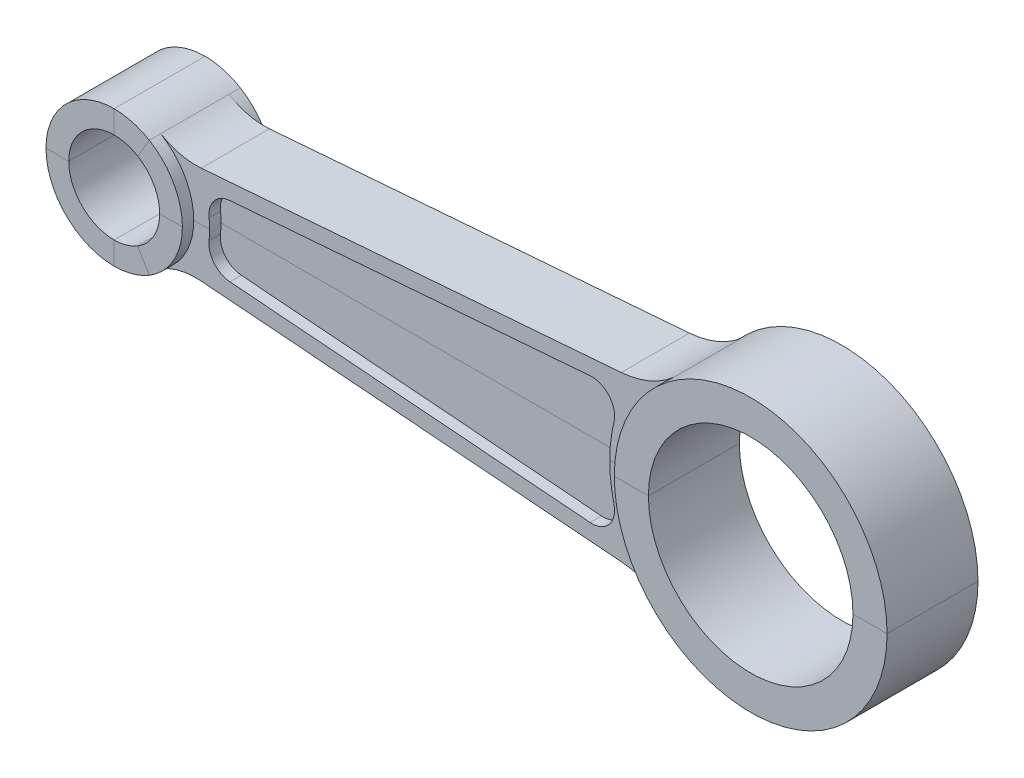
ISO-10303-21;
HEADER;
FILE_DESCRIPTION(('STEP AP214'),'2;1');
FILE_NAME('part.step','',(''),(''),'','','');
FILE_SCHEMA(('AUTOMOTIVE_DESIGN { 1 0 10303 214 1 1 1 1 }'));
ENDSEC;
DATA;
#1=APPLICATION_CONTEXT('core data for automotive mechanical design processes');
#2=APPLICATION_PROTOCOL_DEFINITION('international standard','automotive_design',2000,#1);
#3=PRODUCT_CONTEXT('',#1,'mechanical');
#4=PRODUCT('Part','Part','',(#3));
#5=PRODUCT_RELATED_PRODUCT_CATEGORY('part','',(#4));
#6=PRODUCT_DEFINITION_FORMATION('','',#4);
#7=PRODUCT_DEFINITION_CONTEXT('part definition',#1,'design');
#8=PRODUCT_DEFINITION('design','',#6,#7);
#9=PRODUCT_DEFINITION_SHAPE('','',#8);
#10=(LENGTH_UNIT() NAMED_UNIT(*) SI_UNIT(.MILLI.,.METRE.));
#11=(NAMED_UNIT(*) PLANE_ANGLE_UNIT() SI_UNIT($,.RADIAN.));
#12=(NAMED_UNIT(*) SI_UNIT($,.STERADIAN.) SOLID_ANGLE_UNIT());
#13=UNCERTAINTY_MEASURE_WITH_UNIT(LENGTH_MEASURE(1.E-05),#10,'distance_accuracy_value','');
#14=(GEOMETRIC_REPRESENTATION_CONTEXT(3) GLOBAL_UNCERTAINTY_ASSIGNED_CONTEXT((#13)) GLOBAL_UNIT_ASSIGNED_CONTEXT((#10,
#11,#12)) REPRESENTATION_CONTEXT('',''));
#15=CARTESIAN_POINT('',(0.,0.,0.));
#16=DIRECTION('',(0.,0.,1.));
#17=DIRECTION('',(1.,0.,0.));
#18=AXIS2_PLACEMENT_3D('',#15,#16,#17);
#19=CARTESIAN_POINT('',(0.,0.,-25.4));
#20=DIRECTION('',(0.,0.,1.));
#21=DIRECTION('',(1.,0.,0.));
#22=AXIS2_PLACEMENT_3D('',#19,#20,#21);
#23=CYLINDRICAL_SURFACE('',#22,25.4);
#24=DIRECTION('',(0.,0.,1.));
#25=VECTOR('',#24,1.);
#26=CARTESIAN_POINT('',(-25.4,0.,-25.4));
#27=LINE('',#26,#25);
#28=CARTESIAN_POINT('',(-25.4,0.,-25.4));
#29=VERTEX_POINT('',#28);
#30=CARTESIAN_POINT('',(-25.4,0.,25.4));
#31=VERTEX_POINT('',#30);
#32=EDGE_CURVE('E11',#29,#31,#27,.T.);
#33=ORIENTED_EDGE('',*,*,#32,.F.);
#34=CARTESIAN_POINT('',(0.,0.,-25.4));
#35=DIRECTION('',(0.,0.,1.));
#36=DIRECTION('',(1.,0.,0.));
#37=AXIS2_PLACEMENT_3D('',#34,#35,#36);
#38=CIRCLE('',#37,25.4);
#39=CARTESIAN_POINT('',(0.,25.4,-25.4));
#40=VERTEX_POINT('',#39);
#41=EDGE_CURVE('E418',#40,#29,#38,.T.);
#42=ORIENTED_EDGE('',*,*,#41,.F.);
#43=DIRECTION('',(0.,0.,1.));
#44=VECTOR('',#43,1.);
#45=CARTESIAN_POINT('',(0.,25.4,-25.4));
#46=LINE('',#45,#44);
#47=CARTESIAN_POINT('',(0.,25.4,25.4));
#48=VERTEX_POINT('',#47);
#49=EDGE_CURVE('E570',#48,#40,#46,.F.);
#50=ORIENTED_EDGE('',*,*,#49,.F.);
#51=CARTESIAN_POINT('',(0.,0.,25.4));
#52=DIRECTION('',(0.,0.,1.));
#53=DIRECTION('',(1.,0.,0.));
#54=AXIS2_PLACEMENT_3D('',#51,#52,#53);
#55=CIRCLE('',#54,25.4);
#56=EDGE_CURVE('E407',#48,#31,#55,.T.);
#57=ORIENTED_EDGE('',*,*,#56,.T.);
#58=EDGE_LOOP('',(#33,#42,#50,#57));
#59=FACE_BOUND('',#58,.T.);
#60=ADVANCED_FACE('F40',(#59),#23,.F.);
#61=CARTESIAN_POINT('',(0.,0.,-25.4));
#62=DIRECTION('',(0.,0.,1.));
#63=DIRECTION('',(1.,0.,0.));
#64=AXIS2_PLACEMENT_3D('',#61,#62,#63);
#65=CYLINDRICAL_SURFACE('',#64,38.1);
#66=CARTESIAN_POINT('',(0.,0.,-25.4));
#67=DIRECTION('',(0.,0.,1.));
#68=DIRECTION('',(1.,0.,0.));
#69=AXIS2_PLACEMENT_3D('',#66,#67,#68);
#70=CIRCLE('',#69,38.1);
#71=CARTESIAN_POINT('',(0.,38.1,-25.4));
#72=VERTEX_POINT('',#71);
#73=CARTESIAN_POINT('',(-38.1,0.,-25.4));
#74=VERTEX_POINT('',#73);
#75=EDGE_CURVE('E424',#72,#74,#70,.T.);
#76=ORIENTED_EDGE('',*,*,#75,.T.);
#77=DIRECTION('',(0.,0.,1.));
#78=VECTOR('',#77,1.);
#79=CARTESIAN_POINT('',(-38.1,0.,-25.4));
#80=LINE('',#79,#78);
#81=CARTESIAN_POINT('',(-38.1,0.,25.4));
#82=VERTEX_POINT('',#81);
#83=EDGE_CURVE('E50',#74,#82,#80,.T.);
#84=ORIENTED_EDGE('',*,*,#83,.T.);
#85=CARTESIAN_POINT('',(0.,0.,25.4));
#86=DIRECTION('',(0.,0.,1.));
#87=DIRECTION('',(1.,0.,0.));
#88=AXIS2_PLACEMENT_3D('',#85,#86,#87);
#89=CIRCLE('',#88,38.1);
#90=CARTESIAN_POINT('',(0.,38.1,25.4));
#91=VERTEX_POINT('',#90);
#92=EDGE_CURVE('E412',#91,#82,#89,.T.);
#93=ORIENTED_EDGE('',*,*,#92,.F.);
#94=DIRECTION('',(0.,0.,1.));
#95=VECTOR('',#94,1.);
#96=CARTESIAN_POINT('',(0.,38.1,-25.4));
#97=LINE('',#96,#95);
#98=EDGE_CURVE('E575',#91,#72,#97,.F.);
#99=ORIENTED_EDGE('',*,*,#98,.T.);
#100=EDGE_LOOP('',(#76,#84,#93,#99));
#101=FACE_BOUND('',#100,.T.);
#102=ADVANCED_FACE('F723',(#101),#65,.T.);
#103=CARTESIAN_POINT('',(0.,0.,25.4));
#104=DIRECTION('',(0.,0.,1.));
#105=DIRECTION('',(1.,0.,0.));
#106=AXIS2_PLACEMENT_3D('',#103,#104,#105);
#107=PLANE('',#106);
#108=ORIENTED_EDGE('',*,*,#92,.T.);
#109=DIRECTION('',(1.,0.,0.));
#110=VECTOR('',#109,1.);
#111=CARTESIAN_POINT('',(0.,0.,25.4));
#112=LINE('',#111,#110);
#113=EDGE_CURVE('E628',#82,#31,#112,.T.);
#114=ORIENTED_EDGE('',*,*,#113,.T.);
#115=ORIENTED_EDGE('',*,*,#56,.F.);
#116=DIRECTION('',(0.,1.,0.));
#117=VECTOR('',#116,1.);
#118=CARTESIAN_POINT('',(0.,0.,25.4));
#119=LINE('',#118,#117);
#120=EDGE_CURVE('E580',#48,#91,#119,.T.);
#121=ORIENTED_EDGE('',*,*,#120,.T.);
#122=EDGE_LOOP('',(#108,#114,#115,#121));
#123=FACE_BOUND('',#122,.T.);
#124=ADVANCED_FACE('F730',(#123),#107,.T.);
#125=CARTESIAN_POINT('',(0.,0.,19.05));
#126=DIRECTION('',(0.,0.,1.));
#127=DIRECTION('',(1.,0.,0.));
#128=AXIS2_PLACEMENT_3D('',#125,#126,#127);
#129=PLANE('',#128);
#130=CARTESIAN_POINT('',(0.,0.,19.05));
#131=DIRECTION('',(0.,0.,1.));
#132=DIRECTION('',(1.,0.,0.));
#133=AXIS2_PLACEMENT_3D('',#130,#131,#132);
#134=CIRCLE('',#133,38.1);
#135=CARTESIAN_POINT('',(38.1,0.,19.05));
#136=VERTEX_POINT('',#135);
#137=CARTESIAN_POINT('',(19.6386413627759,32.6486410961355,19.05));
#138=VERTEX_POINT('',#137);
#139=EDGE_CURVE('E446',#136,#138,#134,.T.);
#140=ORIENTED_EDGE('',*,*,#139,.F.);
#141=DIRECTION('',(1.,0.,0.));
#142=VECTOR('',#141,1.);
#143=CARTESIAN_POINT('',(0.,0.,19.05));
#144=LINE('',#143,#142);
#145=CARTESIAN_POINT('',(46.99,0.,19.05));
#146=VERTEX_POINT('',#145);
#147=EDGE_CURVE('E632',#136,#146,#144,.T.);
#148=ORIENTED_EDGE('',*,*,#147,.T.);
#149=CARTESIAN_POINT('',(0.,0.,19.05));
#150=DIRECTION('',(0.,0.,-1.));
#151=DIRECTION('',(1.,0.,0.));
#152=AXIS2_PLACEMENT_3D('',#149,#150,#151);
#153=CIRCLE('',#152,46.99);
#154=CARTESIAN_POINT('',(46.6660517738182,5.50814958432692,19.05));
#155=VERTEX_POINT('',#154);
#156=EDGE_CURVE('E385',#155,#146,#153,.T.);
#157=ORIENTED_EDGE('',*,*,#156,.F.);
#158=CARTESIAN_POINT('',(59.2784981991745,6.99683866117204,19.05));
#159=DIRECTION('',(0.,0.,1.));
#160=DIRECTION('',(1.,0.,0.));
#161=AXIS2_PLACEMENT_3D('',#158,#159,#160);
#162=CIRCLE('',#161,12.7);
#163=CARTESIAN_POINT('',(58.2820676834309,19.6576887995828,19.05));
#164=VERTEX_POINT('',#163);
#165=EDGE_CURVE('E516',#155,#164,#162,.F.);
#166=ORIENTED_EDGE('',*,*,#165,.T.);
#167=DIRECTION('',(-0.996917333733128,-0.0784590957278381,0.));
#168=VECTOR('',#167,1.);
#169=CARTESIAN_POINT('',(278.988917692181,37.0276946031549,19.05));
#170=LINE('',#169,#168);
#171=CARTESIAN_POINT('',(259.516893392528,35.4952130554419,19.05));
#172=VERTEX_POINT('',#171);
#173=EDGE_CURVE('E380',#172,#164,#170,.T.);
#174=ORIENTED_EDGE('',*,*,#173,.F.);
#175=CARTESIAN_POINT('',(260.513323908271,22.8343629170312,19.05));
#176=DIRECTION('',(0.,0.,1.));
#177=DIRECTION('',(1.,0.,0.));
#178=AXIS2_PLACEMENT_3D('',#175,#176,#177);
#179=CIRCLE('',#178,12.7);
#180=CARTESIAN_POINT('',(272.862242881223,19.8688612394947,19.05));
#181=VERTEX_POINT('',#180);
#182=EDGE_CURVE('E510',#172,#181,#179,.F.);
#183=ORIENTED_EDGE('',*,*,#182,.T.);
#184=CARTESIAN_POINT('',(355.6,0.,19.05));
#185=DIRECTION('',(0.,0.,-1.));
#186=DIRECTION('',(1.,0.,0.));
#187=AXIS2_PLACEMENT_3D('',#184,#185,#186);
#188=CIRCLE('',#187,85.09);
#189=CARTESIAN_POINT('',(270.51,0.,19.05));
#190=VERTEX_POINT('',#189);
#191=EDGE_CURVE('E381',#190,#181,#188,.T.);
#192=ORIENTED_EDGE('',*,*,#191,.F.);
#193=CARTESIAN_POINT('',(279.4,0.,19.05));
#194=VERTEX_POINT('',#193);
#195=EDGE_CURVE('E635',#190,#194,#144,.T.);
#196=ORIENTED_EDGE('',*,*,#195,.T.);
#197=CARTESIAN_POINT('',(355.6,0.,19.05));
#198=DIRECTION('',(0.,0.,1.));
#199=DIRECTION('',(1.,0.,0.));
#200=AXIS2_PLACEMENT_3D('',#197,#198,#199);
#201=CIRCLE('',#200,76.2);
#202=CARTESIAN_POINT('',(306.010750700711,57.8562559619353,19.05));
#203=VERTEX_POINT('',#202);
#204=EDGE_CURVE('E441',#203,#194,#201,.T.);
#205=ORIENTED_EDGE('',*,*,#204,.F.);
#206=CARTESIAN_POINT('',(272.951251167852,96.4270932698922,19.05));
#207=DIRECTION('',(0.,0.,1.));
#208=DIRECTION('',(1.,0.,0.));
#209=AXIS2_PLACEMENT_3D('',#206,#207,#208);
#210=CIRCLE('',#209,50.8);
#211=CARTESIAN_POINT('',(276.936973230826,45.7836927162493,19.05));
#212=VERTEX_POINT('',#211);
#213=EDGE_CURVE('E533',#203,#212,#210,.F.);
#214=ORIENTED_EDGE('',*,*,#213,.T.);
#215=DIRECTION('',(0.996917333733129,0.0784590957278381,0.));
#216=VECTOR('',#215,1.);
#217=CARTESIAN_POINT('',(-1.87629689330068,23.8406124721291,19.05));
#218=LINE('',#217,#216);
#219=CARTESIAN_POINT('',(42.2665742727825,27.3147317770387,19.05));
#220=VERTEX_POINT('',#219);
#221=EDGE_CURVE('E444',#220,#212,#218,.T.);
#222=ORIENTED_EDGE('',*,*,#221,.F.);
#223=CARTESIAN_POINT('',(39.2772827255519,65.2972821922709,19.05));
#224=DIRECTION('',(0.,0.,1.));
#225=DIRECTION('',(1.,0.,0.));
#226=AXIS2_PLACEMENT_3D('',#223,#224,#225);
#227=CIRCLE('',#226,38.1);
#228=EDGE_CURVE('E560',#220,#138,#227,.F.);
#229=ORIENTED_EDGE('',*,*,#228,.T.);
#230=EDGE_LOOP('',(#140,#148,#157,#166,#174,#183,#192,#196,#205,#214,#222,#229));
#231=FACE_BOUND('',#230,.T.);
#232=ADVANCED_FACE('F739',(#231),#129,.T.);
#233=DIRECTION('',(0.,0.,1.));
#234=VECTOR('',#233,1.);
#235=CARTESIAN_POINT('',(25.4,0.,-25.4));
#236=LINE('',#235,#234);
#237=CARTESIAN_POINT('',(25.4,0.,25.4));
#238=VERTEX_POINT('',#237);
#239=CARTESIAN_POINT('',(25.4,0.,-25.4));
#240=VERTEX_POINT('',#239);
#241=EDGE_CURVE('E636',#238,#240,#236,.F.);
#242=ORIENTED_EDGE('',*,*,#241,.F.);
#243=CARTESIAN_POINT('',(13.092427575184,21.765760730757,25.4));
#244=VERTEX_POINT('',#243);
#245=EDGE_CURVE('E816',#238,#244,#55,.T.);
#246=ORIENTED_EDGE('',*,*,#245,.T.);
#247=DIRECTION('',(0.,0.,1.));
#248=VECTOR('',#247,1.);
#249=CARTESIAN_POINT('',(13.092427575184,21.765760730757,-25.4));
#250=LINE('',#249,#248);
#251=CARTESIAN_POINT('',(13.092427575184,21.765760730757,-25.4));
#252=VERTEX_POINT('',#251);
#253=EDGE_CURVE('E606',#244,#252,#250,.F.);
#254=ORIENTED_EDGE('',*,*,#253,.T.);
#255=EDGE_CURVE('E793',#240,#252,#38,.T.);
#256=ORIENTED_EDGE('',*,*,#255,.F.);
#257=EDGE_LOOP('',(#242,#246,#254,#256));
#258=FACE_BOUND('',#257,.T.);
#259=ADVANCED_FACE('F725',(#258),#23,.F.);
#260=ORIENTED_EDGE('',*,*,#245,.F.);
#261=DIRECTION('',(1.,0.,0.));
#262=VECTOR('',#261,1.);
#263=CARTESIAN_POINT('',(0.,0.,25.4));
#264=LINE('',#263,#262);
#265=CARTESIAN_POINT('',(38.1,0.,25.4));
#266=VERTEX_POINT('',#265);
#267=EDGE_CURVE('E639',#238,#266,#264,.T.);
#268=ORIENTED_EDGE('',*,*,#267,.T.);
#269=CARTESIAN_POINT('',(19.6386413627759,32.6486410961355,25.4));
#270=VERTEX_POINT('',#269);
#271=EDGE_CURVE('E828',#266,#270,#89,.T.);
#272=ORIENTED_EDGE('',*,*,#271,.T.);
#273=DIRECTION('',(0.515449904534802,0.85691971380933,0.));
#274=VECTOR('',#273,1.);
#275=CARTESIAN_POINT('',(0.,0.,25.4));
#276=LINE('',#275,#274);
#277=EDGE_CURVE('E610',#244,#270,#276,.T.);
#278=ORIENTED_EDGE('',*,*,#277,.F.);
#279=EDGE_LOOP('',(#260,#268,#272,#278));
#280=FACE_BOUND('',#279,.T.);
#281=ADVANCED_FACE('F738',(#280),#107,.T.);
#282=CARTESIAN_POINT('',(355.6,0.,-25.4));
#283=DIRECTION('',(0.,0.,1.));
#284=DIRECTION('',(1.,0.,0.));
#285=AXIS2_PLACEMENT_3D('',#282,#283,#284);
#286=CYLINDRICAL_SURFACE('',#285,76.2);
#287=CARTESIAN_POINT('',(355.6,0.,25.4));
#288=DIRECTION('',(0.,0.,1.));
#289=DIRECTION('',(1.,0.,0.));
#290=AXIS2_PLACEMENT_3D('',#287,#288,#289);
#291=CIRCLE('',#290,76.2);
#292=CARTESIAN_POINT('',(431.8,0.,25.4));
#293=VERTEX_POINT('',#292);
#294=CARTESIAN_POINT('',(279.4,0.,25.4));
#295=VERTEX_POINT('',#294);
#296=EDGE_CURVE('E395',#293,#295,#291,.T.);
#297=ORIENTED_EDGE('',*,*,#296,.F.);
#298=DIRECTION('',(0.,0.,1.));
#299=VECTOR('',#298,1.);
#300=CARTESIAN_POINT('',(431.8,0.,-25.4));
#301=LINE('',#300,#299);
#302=CARTESIAN_POINT('',(431.8,0.,-25.4));
#303=VERTEX_POINT('',#302);
#304=EDGE_CURVE('E642',#293,#303,#301,.F.);
#305=ORIENTED_EDGE('',*,*,#304,.T.);
#306=CARTESIAN_POINT('',(355.6,0.,-25.4));
#307=DIRECTION('',(0.,0.,1.));
#308=DIRECTION('',(1.,0.,0.));
#309=AXIS2_PLACEMENT_3D('',#306,#307,#308);
#310=CIRCLE('',#309,76.2);
#311=CARTESIAN_POINT('',(279.4,0.,-25.4));
#312=VERTEX_POINT('',#311);
#313=EDGE_CURVE('E403',#303,#312,#310,.T.);
#314=ORIENTED_EDGE('',*,*,#313,.T.);
#315=DIRECTION('',(0.,0.,1.));
#316=VECTOR('',#315,1.);
#317=CARTESIAN_POINT('',(279.4,0.,-25.4));
#318=LINE('',#317,#316);
#319=CARTESIAN_POINT('',(279.4,0.,-19.05));
#320=VERTEX_POINT('',#319);
#321=EDGE_CURVE('E643',#312,#320,#318,.T.);
#322=ORIENTED_EDGE('',*,*,#321,.T.);
#323=CARTESIAN_POINT('',(355.6,0.,-19.05));
#324=DIRECTION('',(0.,0.,1.));
#325=DIRECTION('',(1.,0.,0.));
#326=AXIS2_PLACEMENT_3D('',#323,#324,#325);
#327=CIRCLE('',#326,76.2);
#328=CARTESIAN_POINT('',(306.010750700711,57.8562559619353,-19.05));
#329=VERTEX_POINT('',#328);
#330=EDGE_CURVE('E430',#329,#320,#327,.T.);
#331=ORIENTED_EDGE('',*,*,#330,.F.);
#332=DIRECTION('',(0.,0.,1.));
#333=VECTOR('',#332,1.);
#334=CARTESIAN_POINT('',(306.010750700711,57.8562559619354,-25.4));
#335=LINE('',#334,#333);
#336=EDGE_CURVE('E524',#329,#203,#335,.T.);
#337=ORIENTED_EDGE('',*,*,#336,.T.);
#338=ORIENTED_EDGE('',*,*,#204,.T.);
#339=EDGE_CURVE('E646',#194,#295,#318,.T.);
#340=ORIENTED_EDGE('',*,*,#339,.T.);
#341=EDGE_LOOP('',(#297,#305,#314,#322,#331,#337,#338,#340));
#342=FACE_BOUND('',#341,.T.);
#343=ADVANCED_FACE('F885',(#342),#286,.T.);
#344=CARTESIAN_POINT('',(355.6,0.,-25.4));
#345=DIRECTION('',(0.,0.,1.));
#346=DIRECTION('',(1.,0.,0.));
#347=AXIS2_PLACEMENT_3D('',#344,#345,#346);
#348=CYLINDRICAL_SURFACE('',#347,57.15);
#349=DIRECTION('',(0.,0.,1.));
#350=VECTOR('',#349,1.);
#351=CARTESIAN_POINT('',(412.75,0.,-25.4));
#352=LINE('',#351,#350);
#353=CARTESIAN_POINT('',(412.75,0.,25.4));
#354=VERTEX_POINT('',#353);
#355=CARTESIAN_POINT('',(412.75,0.,-25.4));
#356=VERTEX_POINT('',#355);
#357=EDGE_CURVE('E649',#354,#356,#352,.F.);
#358=ORIENTED_EDGE('',*,*,#357,.F.);
#359=CARTESIAN_POINT('',(355.6,0.,25.4));
#360=DIRECTION('',(0.,0.,1.));
#361=DIRECTION('',(1.,0.,0.));
#362=AXIS2_PLACEMENT_3D('',#359,#360,#361);
#363=CIRCLE('',#362,57.15);
#364=CARTESIAN_POINT('',(298.45,0.,25.4));
#365=VERTEX_POINT('',#364);
#366=EDGE_CURVE('E391',#354,#365,#363,.T.);
#367=ORIENTED_EDGE('',*,*,#366,.T.);
#368=DIRECTION('',(0.,0.,1.));
#369=VECTOR('',#368,1.);
#370=CARTESIAN_POINT('',(298.45,0.,-25.4));
#371=LINE('',#370,#369);
#372=CARTESIAN_POINT('',(298.45,0.,-25.4));
#373=VERTEX_POINT('',#372);
#374=EDGE_CURVE('E652',#373,#365,#371,.T.);
#375=ORIENTED_EDGE('',*,*,#374,.F.);
#376=CARTESIAN_POINT('',(355.6,0.,-25.4));
#377=DIRECTION('',(0.,0.,1.));
#378=DIRECTION('',(1.,0.,0.));
#379=AXIS2_PLACEMENT_3D('',#376,#377,#378);
#380=CIRCLE('',#379,57.15);
#381=EDGE_CURVE('E399',#356,#373,#380,.T.);
#382=ORIENTED_EDGE('',*,*,#381,.F.);
#383=EDGE_LOOP('',(#358,#367,#375,#382));
#384=FACE_BOUND('',#383,.T.);
#385=ADVANCED_FACE('F954',(#384),#348,.F.);
#386=CARTESIAN_POINT('',(355.6,0.,25.4));
#387=DIRECTION('',(0.,0.,1.));
#388=DIRECTION('',(1.,0.,0.));
#389=AXIS2_PLACEMENT_3D('',#386,#387,#388);
#390=PLANE('',#389);
#391=ORIENTED_EDGE('',*,*,#296,.T.);
#392=DIRECTION('',(1.,0.,0.));
#393=VECTOR('',#392,1.);
#394=CARTESIAN_POINT('',(355.6,0.,25.4));
#395=LINE('',#394,#393);
#396=EDGE_CURVE('E653',#295,#365,#395,.T.);
#397=ORIENTED_EDGE('',*,*,#396,.T.);
#398=ORIENTED_EDGE('',*,*,#366,.F.);
#399=EDGE_CURVE('E657',#354,#293,#395,.T.);
#400=ORIENTED_EDGE('',*,*,#399,.T.);
#401=EDGE_LOOP('',(#391,#397,#398,#400));
#402=FACE_BOUND('',#401,.T.);
#403=ADVANCED_FACE('F933',(#402),#390,.T.);
#404=CARTESIAN_POINT('',(355.6,0.,12.7));
#405=DIRECTION('',(0.,0.,1.));
#406=DIRECTION('',(1.,0.,0.));
#407=AXIS2_PLACEMENT_3D('',#404,#405,#406);
#408=CYLINDRICAL_SURFACE('',#407,85.09);
#409=DIRECTION('',(0.,0.,1.));
#410=VECTOR('',#409,1.);
#411=CARTESIAN_POINT('',(270.51,0.,12.7));
#412=LINE('',#411,#410);
#413=CARTESIAN_POINT('',(270.51,0.,12.7));
#414=VERTEX_POINT('',#413);
#415=EDGE_CURVE('E660',#190,#414,#412,.F.);
#416=ORIENTED_EDGE('',*,*,#415,.F.);
#417=ORIENTED_EDGE('',*,*,#191,.T.);
#418=DIRECTION('',(0.,0.,1.));
#419=VECTOR('',#418,1.);
#420=CARTESIAN_POINT('',(272.862242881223,19.8688612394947,12.7));
#421=LINE('',#420,#419);
#422=CARTESIAN_POINT('',(272.862242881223,19.8688612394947,12.7));
#423=VERTEX_POINT('',#422);
#424=EDGE_CURVE('E474',#181,#423,#421,.F.);
#425=ORIENTED_EDGE('',*,*,#424,.T.);
#426=CARTESIAN_POINT('',(355.6,0.,12.7));
#427=DIRECTION('',(0.,0.,-1.));
#428=DIRECTION('',(1.,0.,0.));
#429=AXIS2_PLACEMENT_3D('',#426,#427,#428);
#430=CIRCLE('',#429,85.09);
#431=EDGE_CURVE('E366',#414,#423,#430,.T.);
#432=ORIENTED_EDGE('',*,*,#431,.F.);
#433=EDGE_LOOP('',(#416,#417,#425,#432));
#434=FACE_BOUND('',#433,.T.);
#435=ADVANCED_FACE('F964',(#434),#408,.T.);
#436=CARTESIAN_POINT('',(355.6,0.,12.7));
#437=DIRECTION('',(0.,0.,1.));
#438=DIRECTION('',(1.,0.,0.));
#439=AXIS2_PLACEMENT_3D('',#436,#437,#438);
#440=PLANE('',#439);
#441=CARTESIAN_POINT('',(0.,0.,12.7));
#442=DIRECTION('',(0.,0.,-1.));
#443=DIRECTION('',(1.,0.,0.));
#444=AXIS2_PLACEMENT_3D('',#441,#442,#443);
#445=CIRCLE('',#444,46.99);
#446=CARTESIAN_POINT('',(46.6660517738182,5.50814958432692,12.7));
#447=VERTEX_POINT('',#446);
#448=CARTESIAN_POINT('',(46.99,0.,12.7));
#449=VERTEX_POINT('',#448);
#450=EDGE_CURVE('E370',#447,#449,#445,.T.);
#451=ORIENTED_EDGE('',*,*,#450,.T.);
#452=DIRECTION('',(1.,0.,0.));
#453=VECTOR('',#452,1.);
#454=CARTESIAN_POINT('',(355.6,0.,12.7));
#455=LINE('',#454,#453);
#456=EDGE_CURVE('E662',#449,#414,#455,.T.);
#457=ORIENTED_EDGE('',*,*,#456,.T.);
#458=ORIENTED_EDGE('',*,*,#431,.T.);
#459=CARTESIAN_POINT('',(260.513323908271,22.8343629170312,12.7));
#460=DIRECTION('',(0.,0.,1.));
#461=DIRECTION('',(1.,0.,0.));
#462=AXIS2_PLACEMENT_3D('',#459,#460,#461);
#463=CIRCLE('',#462,12.7);
#464=CARTESIAN_POINT('',(259.516893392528,35.4952130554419,12.7));
#465=VERTEX_POINT('',#464);
#466=EDGE_CURVE('E489',#423,#465,#463,.T.);
#467=ORIENTED_EDGE('',*,*,#466,.T.);
#468=DIRECTION('',(-0.996917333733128,-0.0784590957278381,0.));
#469=VECTOR('',#468,1.);
#470=CARTESIAN_POINT('',(278.988917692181,37.0276946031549,12.7));
#471=LINE('',#470,#469);
#472=CARTESIAN_POINT('',(58.2820676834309,19.6576887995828,12.7));
#473=VERTEX_POINT('',#472);
#474=EDGE_CURVE('E365',#465,#473,#471,.T.);
#475=ORIENTED_EDGE('',*,*,#474,.T.);
#476=CARTESIAN_POINT('',(59.2784981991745,6.99683866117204,12.7));
#477=DIRECTION('',(0.,0.,1.));
#478=DIRECTION('',(1.,0.,0.));
#479=AXIS2_PLACEMENT_3D('',#476,#477,#478);
#480=CIRCLE('',#479,12.7);
#481=EDGE_CURVE('E485',#473,#447,#480,.T.);
#482=ORIENTED_EDGE('',*,*,#481,.T.);
#483=EDGE_LOOP('',(#451,#457,#458,#467,#475,#482));
#484=FACE_BOUND('',#483,.T.);
#485=ADVANCED_FACE('F980',(#484),#440,.T.);
#486=CARTESIAN_POINT('',(355.6,0.,-12.7));
#487=DIRECTION('',(0.,0.,-1.));
#488=DIRECTION('',(-1.,0.,0.));
#489=AXIS2_PLACEMENT_3D('',#486,#487,#488);
#490=CYLINDRICAL_SURFACE('',#489,85.09);
#491=DIRECTION('',(0.,0.,-1.));
#492=VECTOR('',#491,1.);
#493=CARTESIAN_POINT('',(270.51,0.,-12.7));
#494=LINE('',#493,#492);
#495=CARTESIAN_POINT('',(270.51,0.,-12.7));
#496=VERTEX_POINT('',#495);
#497=CARTESIAN_POINT('',(270.51,0.,-19.05));
#498=VERTEX_POINT('',#497);
#499=EDGE_CURVE('E44',#496,#498,#494,.T.);
#500=ORIENTED_EDGE('',*,*,#499,.F.);
#501=CARTESIAN_POINT('',(355.6,0.,-12.7));
#502=DIRECTION('',(0.,0.,1.));
#503=DIRECTION('',(-1.,0.,0.));
#504=AXIS2_PLACEMENT_3D('',#501,#502,#503);
#505=CIRCLE('',#504,85.09);
#506=CARTESIAN_POINT('',(272.862242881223,19.8688612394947,-12.7));
#507=VERTEX_POINT('',#506);
#508=EDGE_CURVE('E683',#507,#496,#505,.T.);
#509=ORIENTED_EDGE('',*,*,#508,.F.);
#510=DIRECTION('',(0.,0.,-1.));
#511=VECTOR('',#510,1.);
#512=CARTESIAN_POINT('',(272.862242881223,19.8688612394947,-12.7));
#513=LINE('',#512,#511);
#514=CARTESIAN_POINT('',(272.862242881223,19.8688612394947,-19.05));
#515=VERTEX_POINT('',#514);
#516=EDGE_CURVE('E344',#507,#515,#513,.T.);
#517=ORIENTED_EDGE('',*,*,#516,.T.);
#518=CARTESIAN_POINT('',(355.6,0.,-19.05));
#519=DIRECTION('',(0.,0.,1.));
#520=DIRECTION('',(-1.,0.,0.));
#521=AXIS2_PLACEMENT_3D('',#518,#519,#520);
#522=CIRCLE('',#521,85.09);
#523=EDGE_CURVE('E352',#515,#498,#522,.T.);
#524=ORIENTED_EDGE('',*,*,#523,.T.);
#525=EDGE_LOOP('',(#500,#509,#517,#524));
#526=FACE_BOUND('',#525,.T.);
#527=ADVANCED_FACE('F681',(#526),#490,.T.);
#528=ORIENTED_EDGE('',*,*,#253,.F.);
#529=EDGE_CURVE('E406',#244,#48,#55,.T.);
#530=ORIENTED_EDGE('',*,*,#529,.T.);
#531=ORIENTED_EDGE('',*,*,#49,.T.);
#532=EDGE_CURVE('E415',#252,#40,#38,.T.);
#533=ORIENTED_EDGE('',*,*,#532,.F.);
#534=EDGE_LOOP('',(#528,#530,#531,#533));
#535=FACE_BOUND('',#534,.T.);
#536=ADVANCED_FACE('F741',(#535),#23,.F.);
#537=DIRECTION('',(0.,0.,1.));
#538=VECTOR('',#537,1.);
#539=CARTESIAN_POINT('',(13.092427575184,-21.765760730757,-25.4));
#540=LINE('',#539,#538);
#541=CARTESIAN_POINT('',(13.092427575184,-21.765760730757,-25.4));
#542=VERTEX_POINT('',#541);
#543=CARTESIAN_POINT('',(13.092427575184,-21.765760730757,25.4));
#544=VERTEX_POINT('',#543);
#545=EDGE_CURVE('E605',#542,#544,#540,.T.);
#546=ORIENTED_EDGE('',*,*,#545,.F.);
#547=CARTESIAN_POINT('',(0.,-25.4,-25.4));
#548=VERTEX_POINT('',#547);
#549=EDGE_CURVE('E423',#548,#542,#38,.T.);
#550=ORIENTED_EDGE('',*,*,#549,.F.);
#551=DIRECTION('',(0.,0.,1.));
#552=VECTOR('',#551,1.);
#553=CARTESIAN_POINT('',(0.,-25.4,-25.4));
#554=LINE('',#553,#552);
#555=CARTESIAN_POINT('',(0.,-25.4,25.4));
#556=VERTEX_POINT('',#555);
#557=EDGE_CURVE('E574',#548,#556,#554,.T.);
#558=ORIENTED_EDGE('',*,*,#557,.T.);
#559=EDGE_CURVE('E411',#556,#544,#55,.T.);
#560=ORIENTED_EDGE('',*,*,#559,.T.);
#561=EDGE_LOOP('',(#546,#550,#558,#560));
#562=FACE_BOUND('',#561,.T.);
#563=ADVANCED_FACE('F761',(#562),#23,.F.);
#564=CARTESIAN_POINT('',(0.,0.,-25.4));
#565=DIRECTION('',(0.,0.,1.));
#566=DIRECTION('',(1.,0.,0.));
#567=AXIS2_PLACEMENT_3D('',#564,#565,#566);
#568=PLANE('',#567);
#569=DIRECTION('',(0.515449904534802,0.85691971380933,0.));
#570=VECTOR('',#569,1.);
#571=CARTESIAN_POINT('',(0.,0.,-25.4));
#572=LINE('',#571,#570);
#573=CARTESIAN_POINT('',(19.6386413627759,32.6486410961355,-25.4));
#574=VERTEX_POINT('',#573);
#575=EDGE_CURVE('E602',#252,#574,#572,.T.);
#576=ORIENTED_EDGE('',*,*,#575,.F.);
#577=ORIENTED_EDGE('',*,*,#532,.T.);
#578=DIRECTION('',(0.,1.,0.));
#579=VECTOR('',#578,1.);
#580=CARTESIAN_POINT('',(0.,0.,-25.4));
#581=LINE('',#580,#579);
#582=EDGE_CURVE('E564',#40,#72,#581,.T.);
#583=ORIENTED_EDGE('',*,*,#582,.T.);
#584=EDGE_CURVE('E421',#574,#72,#70,.T.);
#585=ORIENTED_EDGE('',*,*,#584,.F.);
#586=EDGE_LOOP('',(#576,#577,#583,#585));
#587=FACE_BOUND('',#586,.T.);
#588=ADVANCED_FACE('F755',(#587),#568,.F.);
#589=DIRECTION('',(-0.515449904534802,0.85691971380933,0.));
#590=VECTOR('',#589,1.);
#591=CARTESIAN_POINT('',(0.,0.,-25.4));
#592=LINE('',#591,#590);
#593=CARTESIAN_POINT('',(19.6386413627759,-32.6486410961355,-25.4));
#594=VERTEX_POINT('',#593);
#595=EDGE_CURVE('E600',#594,#542,#592,.T.);
#596=ORIENTED_EDGE('',*,*,#595,.F.);
#597=CARTESIAN_POINT('',(0.,-38.1,-25.4));
#598=VERTEX_POINT('',#597);
#599=EDGE_CURVE('E429',#598,#594,#70,.T.);
#600=ORIENTED_EDGE('',*,*,#599,.F.);
#601=DIRECTION('',(0.,1.,0.));
#602=VECTOR('',#601,1.);
#603=CARTESIAN_POINT('',(0.,0.,-25.4));
#604=LINE('',#603,#602);
#605=EDGE_CURVE('E569',#598,#548,#604,.T.);
#606=ORIENTED_EDGE('',*,*,#605,.T.);
#607=ORIENTED_EDGE('',*,*,#549,.T.);
#608=EDGE_LOOP('',(#596,#600,#606,#607));
#609=FACE_BOUND('',#608,.T.);
#610=ADVANCED_FACE('F769',(#609),#568,.F.);
#611=EDGE_CURVE('E409',#270,#91,#89,.T.);
#612=ORIENTED_EDGE('',*,*,#611,.F.);
#613=DIRECTION('',(0.,0.,1.));
#614=VECTOR('',#613,1.);
#615=CARTESIAN_POINT('',(19.6386413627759,32.6486410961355,-25.4));
#616=LINE('',#615,#614);
#617=EDGE_CURVE('E596',#270,#138,#616,.F.);
#618=ORIENTED_EDGE('',*,*,#617,.T.);
#619=DIRECTION('',(0.,0.,1.));
#620=VECTOR('',#619,1.);
#621=CARTESIAN_POINT('',(19.6386413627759,32.6486410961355,-25.4));
#622=LINE('',#621,#620);
#623=CARTESIAN_POINT('',(19.6386413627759,32.6486410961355,-19.05));
#624=VERTEX_POINT('',#623);
#625=EDGE_CURVE('E545',#138,#624,#622,.F.);
#626=ORIENTED_EDGE('',*,*,#625,.T.);
#627=EDGE_CURVE('E601',#624,#574,#616,.F.);
#628=ORIENTED_EDGE('',*,*,#627,.T.);
#629=ORIENTED_EDGE('',*,*,#584,.T.);
#630=ORIENTED_EDGE('',*,*,#98,.F.);
#631=EDGE_LOOP('',(#612,#618,#626,#628,#629,#630));
#632=FACE_BOUND('',#631,.T.);
#633=ADVANCED_FACE('F733',(#632),#65,.T.);
#634=ORIENTED_EDGE('',*,*,#617,.F.);
#635=ORIENTED_EDGE('',*,*,#271,.F.);
#636=CARTESIAN_POINT('',(19.638641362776,-32.6486410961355,25.4));
#637=VERTEX_POINT('',#636);
#638=EDGE_CURVE('E824',#637,#266,#89,.T.);
#639=ORIENTED_EDGE('',*,*,#638,.F.);
#640=DIRECTION('',(0.,0.,1.));
#641=VECTOR('',#640,1.);
#642=CARTESIAN_POINT('',(19.6386413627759,-32.6486410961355,-25.4));
#643=LINE('',#642,#641);
#644=CARTESIAN_POINT('',(19.6386413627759,-32.6486410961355,19.05));
#645=VERTEX_POINT('',#644);
#646=EDGE_CURVE('E614',#645,#637,#643,.T.);
#647=ORIENTED_EDGE('',*,*,#646,.F.);
#648=EDGE_CURVE('E447',#645,#136,#134,.T.);
#649=ORIENTED_EDGE('',*,*,#648,.T.);
#650=ORIENTED_EDGE('',*,*,#139,.T.);
#651=EDGE_LOOP('',(#634,#635,#639,#647,#649,#650));
#652=FACE_BOUND('',#651,.T.);
#653=ADVANCED_FACE('F1219',(#652),#65,.T.);
#654=ORIENTED_EDGE('',*,*,#599,.T.);
#655=CARTESIAN_POINT('',(19.6386413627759,-32.6486410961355,-19.05));
#656=VERTEX_POINT('',#655);
#657=EDGE_CURVE('E620',#594,#656,#643,.T.);
#658=ORIENTED_EDGE('',*,*,#657,.T.);
#659=DIRECTION('',(0.,0.,1.));
#660=VECTOR('',#659,1.);
#661=CARTESIAN_POINT('',(19.638641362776,-32.6486410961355,-25.4));
#662=LINE('',#661,#660);
#663=EDGE_CURVE('E548',#656,#645,#662,.T.);
#664=ORIENTED_EDGE('',*,*,#663,.T.);
#665=ORIENTED_EDGE('',*,*,#646,.T.);
#666=CARTESIAN_POINT('',(0.,-38.1,25.4));
#667=VERTEX_POINT('',#666);
#668=EDGE_CURVE('E417',#667,#637,#89,.T.);
#669=ORIENTED_EDGE('',*,*,#668,.F.);
#670=DIRECTION('',(0.,0.,1.));
#671=VECTOR('',#670,1.);
#672=CARTESIAN_POINT('',(0.,-38.1,-25.4));
#673=LINE('',#672,#671);
#674=EDGE_CURVE('E579',#598,#667,#673,.T.);
#675=ORIENTED_EDGE('',*,*,#674,.F.);
#676=EDGE_LOOP('',(#654,#658,#664,#665,#669,#675));
#677=FACE_BOUND('',#676,.T.);
#678=ADVANCED_FACE('F766',(#677),#65,.T.);
#679=ORIENTED_EDGE('',*,*,#529,.F.);
#680=ORIENTED_EDGE('',*,*,#277,.T.);
#681=ORIENTED_EDGE('',*,*,#611,.T.);
#682=ORIENTED_EDGE('',*,*,#120,.F.);
#683=EDGE_LOOP('',(#679,#680,#681,#682));
#684=FACE_BOUND('',#683,.T.);
#685=ADVANCED_FACE('F807',(#684),#107,.T.);
#686=ORIENTED_EDGE('',*,*,#668,.T.);
#687=DIRECTION('',(-0.515449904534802,0.85691971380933,0.));
#688=VECTOR('',#687,1.);
#689=CARTESIAN_POINT('',(0.,0.,25.4));
#690=LINE('',#689,#688);
#691=EDGE_CURVE('E568',#637,#544,#690,.T.);
#692=ORIENTED_EDGE('',*,*,#691,.T.);
#693=ORIENTED_EDGE('',*,*,#559,.F.);
#694=DIRECTION('',(0.,1.,0.));
#695=VECTOR('',#694,1.);
#696=CARTESIAN_POINT('',(0.,0.,25.4));
#697=LINE('',#696,#695);
#698=EDGE_CURVE('E563',#667,#556,#697,.T.);
#699=ORIENTED_EDGE('',*,*,#698,.F.);
#700=EDGE_LOOP('',(#686,#692,#693,#699));
#701=FACE_BOUND('',#700,.T.);
#702=ADVANCED_FACE('F767',(#701),#107,.T.);
#703=ORIENTED_EDGE('',*,*,#582,.F.);
#704=ORIENTED_EDGE('',*,*,#41,.T.);
#705=EDGE_CURVE('E422',#29,#548,#38,.T.);
#706=ORIENTED_EDGE('',*,*,#705,.T.);
#707=ORIENTED_EDGE('',*,*,#605,.F.);
#708=EDGE_CURVE('E428',#74,#598,#70,.T.);
#709=ORIENTED_EDGE('',*,*,#708,.F.);
#710=ORIENTED_EDGE('',*,*,#75,.F.);
#711=EDGE_LOOP('',(#703,#704,#706,#707,#709,#710));
#712=FACE_BOUND('',#711,.T.);
#713=ADVANCED_FACE('F756',(#712),#568,.F.);
#714=ORIENTED_EDGE('',*,*,#705,.F.);
#715=ORIENTED_EDGE('',*,*,#32,.T.);
#716=EDGE_CURVE('E410',#31,#556,#55,.T.);
#717=ORIENTED_EDGE('',*,*,#716,.T.);
#718=ORIENTED_EDGE('',*,*,#557,.F.);
#719=EDGE_LOOP('',(#714,#715,#717,#718));
#720=FACE_BOUND('',#719,.T.);
#721=ADVANCED_FACE('F746',(#720),#23,.F.);
#722=ORIENTED_EDGE('',*,*,#83,.F.);
#723=ORIENTED_EDGE('',*,*,#708,.T.);
#724=ORIENTED_EDGE('',*,*,#674,.T.);
#725=EDGE_CURVE('E416',#82,#667,#89,.T.);
#726=ORIENTED_EDGE('',*,*,#725,.F.);
#727=EDGE_LOOP('',(#722,#723,#724,#726));
#728=FACE_BOUND('',#727,.T.);
#729=ADVANCED_FACE('F759',(#728),#65,.T.);
#730=ORIENTED_EDGE('',*,*,#113,.F.);
#731=ORIENTED_EDGE('',*,*,#725,.T.);
#732=ORIENTED_EDGE('',*,*,#698,.T.);
#733=ORIENTED_EDGE('',*,*,#716,.F.);
#734=EDGE_LOOP('',(#730,#731,#732,#733));
#735=FACE_BOUND('',#734,.T.);
#736=ADVANCED_FACE('F753',(#735),#107,.T.);
#737=CARTESIAN_POINT('',(-1.87629689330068,23.8406124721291,19.05));
#738=DIRECTION('',(-0.0784590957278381,0.996917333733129,0.));
#739=DIRECTION('',(-0.996917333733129,-0.0784590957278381,0.));
#740=AXIS2_PLACEMENT_3D('',#737,#738,#739);
#741=PLANE('',#740);
#742=DIRECTION('',(0.996917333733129,0.0784590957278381,0.));
#743=VECTOR('',#742,1.);
#744=CARTESIAN_POINT('',(-1.87629689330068,23.8406124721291,-19.05));
#745=LINE('',#744,#743);
#746=CARTESIAN_POINT('',(42.2665742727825,27.3147317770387,-19.05));
#747=VERTEX_POINT('',#746);
#748=CARTESIAN_POINT('',(276.936973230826,45.7836927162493,-19.05));
#749=VERTEX_POINT('',#748);
#750=EDGE_CURVE('E433',#747,#749,#745,.T.);
#751=ORIENTED_EDGE('',*,*,#750,.F.);
#752=DIRECTION('',(0.,0.,-1.));
#753=VECTOR('',#752,1.);
#754=CARTESIAN_POINT('',(42.2665742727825,27.3147317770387,19.05));
#755=LINE('',#754,#753);
#756=EDGE_CURVE('E551',#747,#220,#755,.F.);
#757=ORIENTED_EDGE('',*,*,#756,.T.);
#758=ORIENTED_EDGE('',*,*,#221,.T.);
#759=DIRECTION('',(0.,0.,-1.));
#760=VECTOR('',#759,1.);
#761=CARTESIAN_POINT('',(276.936973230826,45.7836927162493,-19.05));
#762=LINE('',#761,#760);
#763=EDGE_CURVE('E518',#212,#749,#762,.T.);
#764=ORIENTED_EDGE('',*,*,#763,.T.);
#765=EDGE_LOOP('',(#751,#757,#758,#764));
#766=FACE_BOUND('',#765,.T.);
#767=ADVANCED_FACE('F997',(#766),#741,.T.);
#768=CARTESIAN_POINT('',(-1.87629689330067,-23.8406124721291,19.05));
#769=DIRECTION('',(0.0784590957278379,0.996917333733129,0.));
#770=DIRECTION('',(-0.996917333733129,0.0784590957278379,0.));
#771=AXIS2_PLACEMENT_3D('',#768,#769,#770);
#772=PLANE('',#771);
#773=DIRECTION('',(0.996917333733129,-0.0784590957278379,0.));
#774=VECTOR('',#773,1.);
#775=CARTESIAN_POINT('',(-1.87629689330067,-23.8406124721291,19.05));
#776=LINE('',#775,#774);
#777=CARTESIAN_POINT('',(42.2665742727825,-27.3147317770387,19.05));
#778=VERTEX_POINT('',#777);
#779=CARTESIAN_POINT('',(276.936973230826,-45.7836927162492,19.05));
#780=VERTEX_POINT('',#779);
#781=EDGE_CURVE('E450',#778,#780,#776,.T.);
#782=ORIENTED_EDGE('',*,*,#781,.F.);
#783=DIRECTION('',(0.,0.,1.));
#784=VECTOR('',#783,1.);
#785=CARTESIAN_POINT('',(42.2665742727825,-27.3147317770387,19.05));
#786=LINE('',#785,#784);
#787=CARTESIAN_POINT('',(42.2665742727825,-27.3147317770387,-19.05));
#788=VERTEX_POINT('',#787);
#789=EDGE_CURVE('E542',#778,#788,#786,.F.);
#790=ORIENTED_EDGE('',*,*,#789,.T.);
#791=DIRECTION('',(0.996917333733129,-0.0784590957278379,0.));
#792=VECTOR('',#791,1.);
#793=CARTESIAN_POINT('',(-1.87629689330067,-23.8406124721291,-19.05));
#794=LINE('',#793,#792);
#795=CARTESIAN_POINT('',(276.936973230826,-45.7836927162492,-19.05));
#796=VERTEX_POINT('',#795);
#797=EDGE_CURVE('E438',#788,#796,#794,.T.);
#798=ORIENTED_EDGE('',*,*,#797,.T.);
#799=DIRECTION('',(0.,0.,1.));
#800=VECTOR('',#799,1.);
#801=CARTESIAN_POINT('',(276.936973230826,-45.7836927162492,19.05));
#802=LINE('',#801,#800);
#803=EDGE_CURVE('E527',#796,#780,#802,.T.);
#804=ORIENTED_EDGE('',*,*,#803,.T.);
#805=EDGE_LOOP('',(#782,#790,#798,#804));
#806=FACE_BOUND('',#805,.T.);
#807=ADVANCED_FACE('F871',(#806),#772,.F.);
#808=ORIENTED_EDGE('',*,*,#147,.F.);
#809=ORIENTED_EDGE('',*,*,#648,.F.);
#810=CARTESIAN_POINT('',(39.2772827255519,-65.2972821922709,19.05));
#811=DIRECTION('',(0.,0.,1.));
#812=DIRECTION('',(1.,0.,0.));
#813=AXIS2_PLACEMENT_3D('',#810,#811,#812);
#814=CIRCLE('',#813,38.1);
#815=EDGE_CURVE('E556',#645,#778,#814,.F.);
#816=ORIENTED_EDGE('',*,*,#815,.T.);
#817=ORIENTED_EDGE('',*,*,#781,.T.);
#818=CARTESIAN_POINT('',(272.951251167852,-96.4270932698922,19.05));
#819=DIRECTION('',(0.,0.,1.));
#820=DIRECTION('',(1.,0.,0.));
#821=AXIS2_PLACEMENT_3D('',#818,#819,#820);
#822=CIRCLE('',#821,50.8);
#823=CARTESIAN_POINT('',(306.010750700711,-57.8562559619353,19.05));
#824=VERTEX_POINT('',#823);
#825=EDGE_CURVE('E539',#780,#824,#822,.F.);
#826=ORIENTED_EDGE('',*,*,#825,.T.);
#827=EDGE_CURVE('E440',#194,#824,#201,.T.);
#828=ORIENTED_EDGE('',*,*,#827,.F.);
#829=ORIENTED_EDGE('',*,*,#195,.F.);
#830=CARTESIAN_POINT('',(272.862242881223,-19.8688612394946,19.05));
#831=VERTEX_POINT('',#830);
#832=EDGE_CURVE('E377',#831,#190,#188,.T.);
#833=ORIENTED_EDGE('',*,*,#832,.F.);
#834=CARTESIAN_POINT('',(260.513323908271,-22.8343629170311,19.05));
#835=DIRECTION('',(0.,0.,1.));
#836=DIRECTION('',(1.,0.,0.));
#837=AXIS2_PLACEMENT_3D('',#834,#835,#836);
#838=CIRCLE('',#837,12.7);
#839=CARTESIAN_POINT('',(259.516893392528,-35.4952130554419,19.05));
#840=VERTEX_POINT('',#839);
#841=EDGE_CURVE('E508',#831,#840,#838,.F.);
#842=ORIENTED_EDGE('',*,*,#841,.T.);
#843=DIRECTION('',(0.996917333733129,-0.0784590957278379,0.));
#844=VECTOR('',#843,1.);
#845=CARTESIAN_POINT('',(43.2073132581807,-18.4712798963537,19.05));
#846=LINE('',#845,#844);
#847=CARTESIAN_POINT('',(58.2820676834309,-19.6576887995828,19.05));
#848=VERTEX_POINT('',#847);
#849=EDGE_CURVE('E388',#848,#840,#846,.T.);
#850=ORIENTED_EDGE('',*,*,#849,.F.);
#851=CARTESIAN_POINT('',(59.2784981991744,-6.99683866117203,19.05));
#852=DIRECTION('',(0.,0.,1.));
#853=DIRECTION('',(1.,0.,0.));
#854=AXIS2_PLACEMENT_3D('',#851,#852,#853);
#855=CIRCLE('',#854,12.7);
#856=CARTESIAN_POINT('',(46.6660517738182,-5.50814958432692,19.05));
#857=VERTEX_POINT('',#856);
#858=EDGE_CURVE('E513',#848,#857,#855,.F.);
#859=ORIENTED_EDGE('',*,*,#858,.T.);
#860=EDGE_CURVE('E384',#146,#857,#153,.T.);
#861=ORIENTED_EDGE('',*,*,#860,.F.);
#862=EDGE_LOOP('',(#808,#809,#816,#817,#826,#828,#829,#833,#842,#850,#859,#861));
#863=FACE_BOUND('',#862,.T.);
#864=ADVANCED_FACE('F869',(#863),#129,.T.);
#865=CARTESIAN_POINT('',(0.,0.,-19.05));
#866=DIRECTION('',(0.,0.,1.));
#867=DIRECTION('',(1.,0.,0.));
#868=AXIS2_PLACEMENT_3D('',#865,#866,#867);
#869=PLANE('',#868);
#870=DIRECTION('',(0.996917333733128,0.0784590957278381,0.));
#871=VECTOR('',#870,1.);
#872=CARTESIAN_POINT('',(278.988917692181,37.0276946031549,-19.05));
#873=LINE('',#872,#871);
#874=CARTESIAN_POINT('',(58.2820676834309,19.6576887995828,-19.05));
#875=VERTEX_POINT('',#874);
#876=CARTESIAN_POINT('',(259.516893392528,35.4952130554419,-19.05));
#877=VERTEX_POINT('',#876);
#878=EDGE_CURVE('E680',#875,#877,#873,.T.);
#879=ORIENTED_EDGE('',*,*,#878,.F.);
#880=CARTESIAN_POINT('',(59.2784981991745,6.99683866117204,-19.05));
#881=DIRECTION('',(0.,0.,1.));
#882=DIRECTION('',(1.,0.,0.));
#883=AXIS2_PLACEMENT_3D('',#880,#881,#882);
#884=CIRCLE('',#883,12.7);
#885=CARTESIAN_POINT('',(46.6660517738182,5.50814958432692,-19.05));
#886=VERTEX_POINT('',#885);
#887=EDGE_CURVE('E504',#875,#886,#884,.T.);
#888=ORIENTED_EDGE('',*,*,#887,.T.);
#889=CARTESIAN_POINT('',(0.,0.,-19.05));
#890=DIRECTION('',(0.,0.,1.));
#891=DIRECTION('',(-1.,0.,0.));
#892=AXIS2_PLACEMENT_3D('',#889,#890,#891);
#893=CIRCLE('',#892,46.99);
#894=CARTESIAN_POINT('',(46.6660517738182,-5.50814958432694,-19.05));
#895=VERTEX_POINT('',#894);
#896=EDGE_CURVE('E694',#895,#886,#893,.T.);
#897=ORIENTED_EDGE('',*,*,#896,.F.);
#898=CARTESIAN_POINT('',(59.2784981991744,-6.99683866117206,-19.05));
#899=DIRECTION('',(0.,0.,1.));
#900=DIRECTION('',(1.,0.,0.));
#901=AXIS2_PLACEMENT_3D('',#898,#899,#900);
#902=CIRCLE('',#901,12.7);
#903=CARTESIAN_POINT('',(58.2820676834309,-19.6576887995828,-19.05));
#904=VERTEX_POINT('',#903);
#905=EDGE_CURVE('E333',#895,#904,#902,.T.);
#906=ORIENTED_EDGE('',*,*,#905,.T.);
#907=DIRECTION('',(-0.996917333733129,0.0784590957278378,0.));
#908=VECTOR('',#907,1.);
#909=CARTESIAN_POINT('',(43.2073132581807,-18.4712798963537,-19.05));
#910=LINE('',#909,#908);
#911=CARTESIAN_POINT('',(259.516893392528,-35.4952130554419,-19.05));
#912=VERTEX_POINT('',#911);
#913=EDGE_CURVE('E340',#912,#904,#910,.T.);
#914=ORIENTED_EDGE('',*,*,#913,.F.);
#915=CARTESIAN_POINT('',(260.513323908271,-22.8343629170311,-19.05));
#916=DIRECTION('',(0.,0.,1.));
#917=DIRECTION('',(1.,0.,0.));
#918=AXIS2_PLACEMENT_3D('',#915,#916,#917);
#919=CIRCLE('',#918,12.7);
#920=CARTESIAN_POINT('',(272.862242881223,-19.8688612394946,-19.05));
#921=VERTEX_POINT('',#920);
#922=EDGE_CURVE('E323',#912,#921,#919,.T.);
#923=ORIENTED_EDGE('',*,*,#922,.T.);
#924=EDGE_CURVE('E358',#498,#921,#522,.T.);
#925=ORIENTED_EDGE('',*,*,#924,.F.);
#926=ORIENTED_EDGE('',*,*,#523,.F.);
#927=CARTESIAN_POINT('',(260.513323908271,22.8343629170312,-19.05));
#928=DIRECTION('',(0.,0.,1.));
#929=DIRECTION('',(1.,0.,0.));
#930=AXIS2_PLACEMENT_3D('',#927,#928,#929);
#931=CIRCLE('',#930,12.7);
#932=EDGE_CURVE('E506',#515,#877,#931,.T.);
#933=ORIENTED_EDGE('',*,*,#932,.T.);
#934=EDGE_LOOP('',(#879,#888,#897,#906,#914,#923,#925,#926,#933));
#935=FACE_BOUND('',#934,.T.);
#936=ORIENTED_EDGE('',*,*,#330,.T.);
#937=CARTESIAN_POINT('',(306.010750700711,-57.8562559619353,-19.05));
#938=VERTEX_POINT('',#937);
#939=EDGE_CURVE('E427',#320,#938,#327,.T.);
#940=ORIENTED_EDGE('',*,*,#939,.T.);
#941=CARTESIAN_POINT('',(272.951251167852,-96.4270932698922,-19.05));
#942=DIRECTION('',(0.,0.,1.));
#943=DIRECTION('',(1.,0.,0.));
#944=AXIS2_PLACEMENT_3D('',#941,#942,#943);
#945=CIRCLE('',#944,50.8);
#946=EDGE_CURVE('E536',#938,#796,#945,.T.);
#947=ORIENTED_EDGE('',*,*,#946,.T.);
#948=ORIENTED_EDGE('',*,*,#797,.F.);
#949=CARTESIAN_POINT('',(39.2772827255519,-65.2972821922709,-19.05));
#950=DIRECTION('',(0.,0.,1.));
#951=DIRECTION('',(1.,0.,0.));
#952=AXIS2_PLACEMENT_3D('',#949,#950,#951);
#953=CIRCLE('',#952,38.1);
#954=EDGE_CURVE('E553',#788,#656,#953,.T.);
#955=ORIENTED_EDGE('',*,*,#954,.T.);
#956=CARTESIAN_POINT('',(0.,0.,-19.05));
#957=DIRECTION('',(0.,0.,1.));
#958=DIRECTION('',(1.,0.,0.));
#959=AXIS2_PLACEMENT_3D('',#956,#957,#958);
#960=CIRCLE('',#959,38.1);
#961=EDGE_CURVE('E435',#656,#624,#960,.T.);
#962=ORIENTED_EDGE('',*,*,#961,.T.);
#963=CARTESIAN_POINT('',(39.2772827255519,65.2972821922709,-19.05));
#964=DIRECTION('',(0.,0.,1.));
#965=DIRECTION('',(1.,0.,0.));
#966=AXIS2_PLACEMENT_3D('',#963,#964,#965);
#967=CIRCLE('',#966,38.1);
#968=EDGE_CURVE('E558',#624,#747,#967,.T.);
#969=ORIENTED_EDGE('',*,*,#968,.T.);
#970=ORIENTED_EDGE('',*,*,#750,.T.);
#971=CARTESIAN_POINT('',(272.951251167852,96.4270932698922,-19.05));
#972=DIRECTION('',(0.,0.,1.));
#973=DIRECTION('',(1.,0.,0.));
#974=AXIS2_PLACEMENT_3D('',#971,#972,#973);
#975=CIRCLE('',#974,50.8);
#976=EDGE_CURVE('E530',#749,#329,#975,.T.);
#977=ORIENTED_EDGE('',*,*,#976,.T.);
#978=EDGE_LOOP('',(#936,#940,#947,#948,#955,#962,#969,#970,#977));
#979=FACE_BOUND('',#978,.T.);
#980=ADVANCED_FACE('F348',(#935,#979),#869,.F.);
#981=ORIENTED_EDGE('',*,*,#627,.F.);
#982=ORIENTED_EDGE('',*,*,#961,.F.);
#983=ORIENTED_EDGE('',*,*,#657,.F.);
#984=EDGE_CURVE('E787',#594,#574,#70,.T.);
#985=ORIENTED_EDGE('',*,*,#984,.T.);
#986=EDGE_LOOP('',(#981,#982,#983,#985));
#987=FACE_BOUND('',#986,.T.);
#988=ADVANCED_FACE('F734',(#987),#65,.T.);
#989=EDGE_CURVE('E785',#542,#240,#38,.T.);
#990=ORIENTED_EDGE('',*,*,#989,.T.);
#991=ORIENTED_EDGE('',*,*,#255,.T.);
#992=ORIENTED_EDGE('',*,*,#575,.T.);
#993=ORIENTED_EDGE('',*,*,#984,.F.);
#994=ORIENTED_EDGE('',*,*,#595,.T.);
#995=EDGE_LOOP('',(#990,#991,#992,#993,#994));
#996=FACE_BOUND('',#995,.T.);
#997=ADVANCED_FACE('F744',(#996),#568,.F.);
#998=EDGE_CURVE('E817',#544,#238,#55,.T.);
#999=ORIENTED_EDGE('',*,*,#998,.T.);
#1000=ORIENTED_EDGE('',*,*,#241,.T.);
#1001=ORIENTED_EDGE('',*,*,#989,.F.);
#1002=ORIENTED_EDGE('',*,*,#545,.T.);
#1003=EDGE_LOOP('',(#999,#1000,#1001,#1002));
#1004=FACE_BOUND('',#1003,.T.);
#1005=ADVANCED_FACE('F726',(#1004),#23,.F.);
#1006=ORIENTED_EDGE('',*,*,#267,.F.);
#1007=ORIENTED_EDGE('',*,*,#998,.F.);
#1008=ORIENTED_EDGE('',*,*,#691,.F.);
#1009=ORIENTED_EDGE('',*,*,#638,.T.);
#1010=EDGE_LOOP('',(#1006,#1007,#1008,#1009));
#1011=FACE_BOUND('',#1010,.T.);
#1012=ADVANCED_FACE('F743',(#1011),#107,.T.);
#1013=ORIENTED_EDGE('',*,*,#304,.F.);
#1014=EDGE_CURVE('E394',#295,#293,#291,.T.);
#1015=ORIENTED_EDGE('',*,*,#1014,.F.);
#1016=ORIENTED_EDGE('',*,*,#339,.F.);
#1017=ORIENTED_EDGE('',*,*,#827,.T.);
#1018=DIRECTION('',(0.,0.,1.));
#1019=VECTOR('',#1018,1.);
#1020=CARTESIAN_POINT('',(306.010750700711,-57.8562559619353,-25.4));
#1021=LINE('',#1020,#1019);
#1022=EDGE_CURVE('E521',#824,#938,#1021,.F.);
#1023=ORIENTED_EDGE('',*,*,#1022,.T.);
#1024=ORIENTED_EDGE('',*,*,#939,.F.);
#1025=ORIENTED_EDGE('',*,*,#321,.F.);
#1026=EDGE_CURVE('E402',#312,#303,#310,.T.);
#1027=ORIENTED_EDGE('',*,*,#1026,.T.);
#1028=EDGE_LOOP('',(#1013,#1015,#1016,#1017,#1023,#1024,#1025,#1027));
#1029=FACE_BOUND('',#1028,.T.);
#1030=ADVANCED_FACE('F751',(#1029),#286,.T.);
#1031=CARTESIAN_POINT('',(355.6,0.,-25.4));
#1032=DIRECTION('',(0.,0.,1.));
#1033=DIRECTION('',(1.,0.,0.));
#1034=AXIS2_PLACEMENT_3D('',#1031,#1032,#1033);
#1035=PLANE('',#1034);
#1036=ORIENTED_EDGE('',*,*,#381,.T.);
#1037=EDGE_CURVE('E398',#373,#356,#380,.T.);
#1038=ORIENTED_EDGE('',*,*,#1037,.T.);
#1039=EDGE_LOOP('',(#1036,#1038));
#1040=FACE_BOUND('',#1039,.T.);
#1041=ORIENTED_EDGE('',*,*,#313,.F.);
#1042=ORIENTED_EDGE('',*,*,#1026,.F.);
#1043=EDGE_LOOP('',(#1041,#1042));
#1044=FACE_BOUND('',#1043,.T.);
#1045=ADVANCED_FACE('F943',(#1040,#1044),#1035,.F.);
#1046=EDGE_CURVE('E376',#365,#354,#363,.T.);
#1047=ORIENTED_EDGE('',*,*,#1046,.T.);
#1048=ORIENTED_EDGE('',*,*,#357,.T.);
#1049=ORIENTED_EDGE('',*,*,#1037,.F.);
#1050=ORIENTED_EDGE('',*,*,#374,.T.);
#1051=EDGE_LOOP('',(#1047,#1048,#1049,#1050));
#1052=FACE_BOUND('',#1051,.T.);
#1053=ADVANCED_FACE('F945',(#1052),#348,.F.);
#1054=ORIENTED_EDGE('',*,*,#396,.F.);
#1055=ORIENTED_EDGE('',*,*,#1014,.T.);
#1056=ORIENTED_EDGE('',*,*,#399,.F.);
#1057=ORIENTED_EDGE('',*,*,#1046,.F.);
#1058=EDGE_LOOP('',(#1054,#1055,#1056,#1057));
#1059=FACE_BOUND('',#1058,.T.);
#1060=ADVANCED_FACE('F937',(#1059),#390,.T.);
#1061=ORIENTED_EDGE('',*,*,#832,.T.);
#1062=ORIENTED_EDGE('',*,*,#415,.T.);
#1063=CARTESIAN_POINT('',(272.862242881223,-19.8688612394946,12.7));
#1064=VERTEX_POINT('',#1063);
#1065=EDGE_CURVE('E362',#1064,#414,#430,.T.);
#1066=ORIENTED_EDGE('',*,*,#1065,.F.);
#1067=DIRECTION('',(0.,0.,1.));
#1068=VECTOR('',#1067,1.);
#1069=CARTESIAN_POINT('',(272.862242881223,-19.8688612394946,12.7));
#1070=LINE('',#1069,#1068);
#1071=EDGE_CURVE('E477',#1064,#831,#1070,.T.);
#1072=ORIENTED_EDGE('',*,*,#1071,.T.);
#1073=EDGE_LOOP('',(#1061,#1062,#1066,#1072));
#1074=FACE_BOUND('',#1073,.T.);
#1075=ADVANCED_FACE('F959',(#1074),#408,.T.);
#1076=CARTESIAN_POINT('',(43.2073132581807,-18.4712798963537,12.7));
#1077=DIRECTION('',(-0.0784590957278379,-0.996917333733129,0.));
#1078=DIRECTION('',(0.996917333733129,-0.0784590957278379,0.));
#1079=AXIS2_PLACEMENT_3D('',#1076,#1077,#1078);
#1080=PLANE('',#1079);
#1081=ORIENTED_EDGE('',*,*,#849,.T.);
#1082=DIRECTION('',(0.,0.,-1.));
#1083=VECTOR('',#1082,1.);
#1084=CARTESIAN_POINT('',(259.516893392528,-35.4952130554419,12.7));
#1085=LINE('',#1084,#1083);
#1086=CARTESIAN_POINT('',(259.516893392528,-35.4952130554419,12.7));
#1087=VERTEX_POINT('',#1086);
#1088=EDGE_CURVE('E483',#840,#1087,#1085,.T.);
#1089=ORIENTED_EDGE('',*,*,#1088,.T.);
#1090=DIRECTION('',(0.996917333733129,-0.0784590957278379,0.));
#1091=VECTOR('',#1090,1.);
#1092=CARTESIAN_POINT('',(43.2073132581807,-18.4712798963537,12.7));
#1093=LINE('',#1092,#1091);
#1094=CARTESIAN_POINT('',(58.2820676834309,-19.6576887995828,12.7));
#1095=VERTEX_POINT('',#1094);
#1096=EDGE_CURVE('E373',#1095,#1087,#1093,.T.);
#1097=ORIENTED_EDGE('',*,*,#1096,.F.);
#1098=DIRECTION('',(0.,0.,-1.));
#1099=VECTOR('',#1098,1.);
#1100=CARTESIAN_POINT('',(58.2820676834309,-19.6576887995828,19.05));
#1101=LINE('',#1100,#1099);
#1102=EDGE_CURVE('E480',#1095,#848,#1101,.F.);
#1103=ORIENTED_EDGE('',*,*,#1102,.T.);
#1104=EDGE_LOOP('',(#1081,#1089,#1097,#1103));
#1105=FACE_BOUND('',#1104,.T.);
#1106=ADVANCED_FACE('F962',(#1105),#1080,.F.);
#1107=CARTESIAN_POINT('',(0.,0.,12.7));
#1108=DIRECTION('',(0.,0.,1.));
#1109=DIRECTION('',(1.,0.,0.));
#1110=AXIS2_PLACEMENT_3D('',#1107,#1108,#1109);
#1111=CYLINDRICAL_SURFACE('',#1110,46.99);
#1112=ORIENTED_EDGE('',*,*,#156,.T.);
#1113=ORIENTED_EDGE('',*,*,#860,.T.);
#1114=DIRECTION('',(0.,0.,1.));
#1115=VECTOR('',#1114,1.);
#1116=CARTESIAN_POINT('',(46.6660517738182,-5.50814958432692,12.7));
#1117=LINE('',#1116,#1115);
#1118=CARTESIAN_POINT('',(46.6660517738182,-5.50814958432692,12.7));
#1119=VERTEX_POINT('',#1118);
#1120=EDGE_CURVE('E334',#857,#1119,#1117,.F.);
#1121=ORIENTED_EDGE('',*,*,#1120,.T.);
#1122=EDGE_CURVE('E369',#449,#1119,#445,.T.);
#1123=ORIENTED_EDGE('',*,*,#1122,.F.);
#1124=ORIENTED_EDGE('',*,*,#450,.F.);
#1125=DIRECTION('',(0.,0.,1.));
#1126=VECTOR('',#1125,1.);
#1127=CARTESIAN_POINT('',(46.6660517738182,5.50814958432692,12.7));
#1128=LINE('',#1127,#1126);
#1129=EDGE_CURVE('E498',#447,#155,#1128,.T.);
#1130=ORIENTED_EDGE('',*,*,#1129,.T.);
#1131=EDGE_LOOP('',(#1112,#1113,#1121,#1123,#1124,#1130));
#1132=FACE_BOUND('',#1131,.T.);
#1133=ADVANCED_FACE('F969',(#1132),#1111,.T.);
#1134=CARTESIAN_POINT('',(278.988917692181,37.0276946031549,12.7));
#1135=DIRECTION('',(-0.0784590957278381,0.996917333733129,0.));
#1136=DIRECTION('',(-0.996917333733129,-0.0784590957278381,0.));
#1137=AXIS2_PLACEMENT_3D('',#1134,#1135,#1136);
#1138=PLANE('',#1137);
#1139=ORIENTED_EDGE('',*,*,#474,.F.);
#1140=DIRECTION('',(0.,0.,-1.));
#1141=VECTOR('',#1140,1.);
#1142=CARTESIAN_POINT('',(259.516893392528,35.4952130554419,19.05));
#1143=LINE('',#1142,#1141);
#1144=EDGE_CURVE('E495',#465,#172,#1143,.F.);
#1145=ORIENTED_EDGE('',*,*,#1144,.T.);
#1146=ORIENTED_EDGE('',*,*,#173,.T.);
#1147=DIRECTION('',(0.,0.,-1.));
#1148=VECTOR('',#1147,1.);
#1149=CARTESIAN_POINT('',(58.2820676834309,19.6576887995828,12.7));
#1150=LINE('',#1149,#1148);
#1151=EDGE_CURVE('E493',#164,#473,#1150,.T.);
#1152=ORIENTED_EDGE('',*,*,#1151,.T.);
#1153=EDGE_LOOP('',(#1139,#1145,#1146,#1152));
#1154=FACE_BOUND('',#1153,.T.);
#1155=ADVANCED_FACE('F965',(#1154),#1138,.F.);
#1156=ORIENTED_EDGE('',*,*,#456,.F.);
#1157=ORIENTED_EDGE('',*,*,#1122,.T.);
#1158=CARTESIAN_POINT('',(59.2784981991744,-6.99683866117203,12.7));
#1159=DIRECTION('',(0.,0.,1.));
#1160=DIRECTION('',(1.,0.,0.));
#1161=AXIS2_PLACEMENT_3D('',#1158,#1159,#1160);
#1162=CIRCLE('',#1161,12.7);
#1163=EDGE_CURVE('E487',#1119,#1095,#1162,.T.);
#1164=ORIENTED_EDGE('',*,*,#1163,.T.);
#1165=ORIENTED_EDGE('',*,*,#1096,.T.);
#1166=CARTESIAN_POINT('',(260.513323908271,-22.8343629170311,12.7));
#1167=DIRECTION('',(0.,0.,1.));
#1168=DIRECTION('',(1.,0.,0.));
#1169=AXIS2_PLACEMENT_3D('',#1166,#1167,#1168);
#1170=CIRCLE('',#1169,12.7);
#1171=EDGE_CURVE('E491',#1087,#1064,#1170,.T.);
#1172=ORIENTED_EDGE('',*,*,#1171,.T.);
#1173=ORIENTED_EDGE('',*,*,#1065,.T.);
#1174=EDGE_LOOP('',(#1156,#1157,#1164,#1165,#1172,#1173));
#1175=FACE_BOUND('',#1174,.T.);
#1176=ADVANCED_FACE('F968',(#1175),#440,.T.);
#1177=CARTESIAN_POINT('',(0.,0.,-12.7));
#1178=DIRECTION('',(0.,0.,-1.));
#1179=DIRECTION('',(-1.,0.,0.));
#1180=AXIS2_PLACEMENT_3D('',#1177,#1178,#1179);
#1181=CYLINDRICAL_SURFACE('',#1180,46.99);
#1182=CARTESIAN_POINT('',(0.,0.,-12.7));
#1183=DIRECTION('',(0.,0.,1.));
#1184=DIRECTION('',(-1.,0.,0.));
#1185=AXIS2_PLACEMENT_3D('',#1182,#1183,#1184);
#1186=CIRCLE('',#1185,46.99);
#1187=CARTESIAN_POINT('',(46.6660517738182,-5.50814958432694,-12.7));
#1188=VERTEX_POINT('',#1187);
#1189=CARTESIAN_POINT('',(46.6660517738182,5.50814958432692,-12.7));
#1190=VERTEX_POINT('',#1189);
#1191=EDGE_CURVE('E351',#1188,#1190,#1186,.T.);
#1192=ORIENTED_EDGE('',*,*,#1191,.F.);
#1193=DIRECTION('',(0.,0.,-1.));
#1194=VECTOR('',#1193,1.);
#1195=CARTESIAN_POINT('',(46.6660517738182,-5.50814958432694,-12.7));
#1196=LINE('',#1195,#1194);
#1197=EDGE_CURVE('E466',#1188,#895,#1196,.T.);
#1198=ORIENTED_EDGE('',*,*,#1197,.T.);
#1199=ORIENTED_EDGE('',*,*,#896,.T.);
#1200=DIRECTION('',(0.,0.,-1.));
#1201=VECTOR('',#1200,1.);
#1202=CARTESIAN_POINT('',(46.6660517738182,5.50814958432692,-12.7));
#1203=LINE('',#1202,#1201);
#1204=EDGE_CURVE('E464',#886,#1190,#1203,.F.);
#1205=ORIENTED_EDGE('',*,*,#1204,.T.);
#1206=EDGE_LOOP('',(#1192,#1198,#1199,#1205));
#1207=FACE_BOUND('',#1206,.T.);
#1208=ADVANCED_FACE('F708',(#1207),#1181,.T.);
#1209=CARTESIAN_POINT('',(43.2073132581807,-18.4712798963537,-12.7));
#1210=DIRECTION('',(-0.0784590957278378,-0.996917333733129,0.));
#1211=DIRECTION('',(0.996917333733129,-0.0784590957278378,0.));
#1212=AXIS2_PLACEMENT_3D('',#1209,#1210,#1211);
#1213=PLANE('',#1212);
#1214=DIRECTION('',(-0.996917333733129,0.0784590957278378,0.));
#1215=VECTOR('',#1214,1.);
#1216=CARTESIAN_POINT('',(43.2073132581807,-18.4712798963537,-12.7));
#1217=LINE('',#1216,#1215);
#1218=CARTESIAN_POINT('',(259.516893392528,-35.4952130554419,-12.7));
#1219=VERTEX_POINT('',#1218);
#1220=CARTESIAN_POINT('',(58.2820676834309,-19.6576887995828,-12.7));
#1221=VERTEX_POINT('',#1220);
#1222=EDGE_CURVE('E343',#1219,#1221,#1217,.T.);
#1223=ORIENTED_EDGE('',*,*,#1222,.F.);
#1224=DIRECTION('',(0.,0.,1.));
#1225=VECTOR('',#1224,1.);
#1226=CARTESIAN_POINT('',(259.516893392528,-35.4952130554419,-19.05));
#1227=LINE('',#1226,#1225);
#1228=EDGE_CURVE('E327',#1219,#912,#1227,.F.);
#1229=ORIENTED_EDGE('',*,*,#1228,.T.);
#1230=ORIENTED_EDGE('',*,*,#913,.T.);
#1231=DIRECTION('',(0.,0.,1.));
#1232=VECTOR('',#1231,1.);
#1233=CARTESIAN_POINT('',(58.2820676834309,-19.6576887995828,-12.7));
#1234=LINE('',#1233,#1232);
#1235=EDGE_CURVE('E345',#904,#1221,#1234,.T.);
#1236=ORIENTED_EDGE('',*,*,#1235,.T.);
#1237=EDGE_LOOP('',(#1223,#1229,#1230,#1236));
#1238=FACE_BOUND('',#1237,.T.);
#1239=ADVANCED_FACE('F339',(#1238),#1213,.F.);
#1240=CARTESIAN_POINT('',(272.862242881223,-19.8688612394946,-12.7));
#1241=VERTEX_POINT('',#1240);
#1242=EDGE_CURVE('E675',#496,#1241,#505,.T.);
#1243=ORIENTED_EDGE('',*,*,#1242,.F.);
#1244=ORIENTED_EDGE('',*,*,#499,.T.);
#1245=ORIENTED_EDGE('',*,*,#924,.T.);
#1246=DIRECTION('',(0.,0.,-1.));
#1247=VECTOR('',#1246,1.);
#1248=CARTESIAN_POINT('',(272.862242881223,-19.8688612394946,-12.7));
#1249=LINE('',#1248,#1247);
#1250=EDGE_CURVE('E329',#921,#1241,#1249,.F.);
#1251=ORIENTED_EDGE('',*,*,#1250,.T.);
#1252=EDGE_LOOP('',(#1243,#1244,#1245,#1251));
#1253=FACE_BOUND('',#1252,.T.);
#1254=ADVANCED_FACE('F674',(#1253),#490,.T.);
#1255=CARTESIAN_POINT('',(278.988917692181,37.0276946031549,-12.7));
#1256=DIRECTION('',(-0.0784590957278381,0.996917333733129,0.));
#1257=DIRECTION('',(-0.996917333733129,-0.0784590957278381,0.));
#1258=AXIS2_PLACEMENT_3D('',#1255,#1256,#1257);
#1259=PLANE('',#1258);
#1260=DIRECTION('',(0.996917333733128,0.0784590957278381,0.));
#1261=VECTOR('',#1260,1.);
#1262=CARTESIAN_POINT('',(278.988917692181,37.0276946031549,-12.7));
#1263=LINE('',#1262,#1261);
#1264=CARTESIAN_POINT('',(58.2820676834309,19.6576887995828,-12.7));
#1265=VERTEX_POINT('',#1264);
#1266=CARTESIAN_POINT('',(259.516893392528,35.4952130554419,-12.7));
#1267=VERTEX_POINT('',#1266);
#1268=EDGE_CURVE('E355',#1265,#1267,#1263,.T.);
#1269=ORIENTED_EDGE('',*,*,#1268,.F.);
#1270=DIRECTION('',(0.,0.,1.));
#1271=VECTOR('',#1270,1.);
#1272=CARTESIAN_POINT('',(58.2820676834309,19.6576887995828,-19.05));
#1273=LINE('',#1272,#1271);
#1274=EDGE_CURVE('E471',#1265,#875,#1273,.F.);
#1275=ORIENTED_EDGE('',*,*,#1274,.T.);
#1276=ORIENTED_EDGE('',*,*,#878,.T.);
#1277=DIRECTION('',(0.,0.,1.));
#1278=VECTOR('',#1277,1.);
#1279=CARTESIAN_POINT('',(259.516893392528,35.4952130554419,-12.7));
#1280=LINE('',#1279,#1278);
#1281=EDGE_CURVE('E469',#877,#1267,#1280,.T.);
#1282=ORIENTED_EDGE('',*,*,#1281,.T.);
#1283=EDGE_LOOP('',(#1269,#1275,#1276,#1282));
#1284=FACE_BOUND('',#1283,.T.);
#1285=ADVANCED_FACE('F691',(#1284),#1259,.F.);
#1286=CARTESIAN_POINT('',(0.,0.,-12.7));
#1287=DIRECTION('',(0.,0.,-1.));
#1288=DIRECTION('',(-1.,0.,0.));
#1289=AXIS2_PLACEMENT_3D('',#1286,#1287,#1288);
#1290=PLANE('',#1289);
#1291=ORIENTED_EDGE('',*,*,#508,.T.);
#1292=ORIENTED_EDGE('',*,*,#1242,.T.);
#1293=CARTESIAN_POINT('',(260.513323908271,-22.8343629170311,-12.7));
#1294=DIRECTION('',(0.,0.,-1.));
#1295=DIRECTION('',(-1.,0.,0.));
#1296=AXIS2_PLACEMENT_3D('',#1293,#1294,#1295);
#1297=CIRCLE('',#1296,12.7);
#1298=EDGE_CURVE('E462',#1241,#1219,#1297,.T.);
#1299=ORIENTED_EDGE('',*,*,#1298,.T.);
#1300=ORIENTED_EDGE('',*,*,#1222,.T.);
#1301=CARTESIAN_POINT('',(59.2784981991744,-6.99683866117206,-12.7));
#1302=DIRECTION('',(0.,0.,-1.));
#1303=DIRECTION('',(-1.,0.,0.));
#1304=AXIS2_PLACEMENT_3D('',#1301,#1302,#1303);
#1305=CIRCLE('',#1304,12.7);
#1306=EDGE_CURVE('E460',#1221,#1188,#1305,.T.);
#1307=ORIENTED_EDGE('',*,*,#1306,.T.);
#1308=ORIENTED_EDGE('',*,*,#1191,.T.);
#1309=CARTESIAN_POINT('',(59.2784981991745,6.99683866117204,-12.7));
#1310=DIRECTION('',(0.,0.,-1.));
#1311=DIRECTION('',(-1.,0.,0.));
#1312=AXIS2_PLACEMENT_3D('',#1309,#1310,#1311);
#1313=CIRCLE('',#1312,12.7);
#1314=EDGE_CURVE('E458',#1190,#1265,#1313,.T.);
#1315=ORIENTED_EDGE('',*,*,#1314,.T.);
#1316=ORIENTED_EDGE('',*,*,#1268,.T.);
#1317=CARTESIAN_POINT('',(260.513323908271,22.8343629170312,-12.7));
#1318=DIRECTION('',(0.,0.,-1.));
#1319=DIRECTION('',(-1.,0.,0.));
#1320=AXIS2_PLACEMENT_3D('',#1317,#1318,#1319);
#1321=CIRCLE('',#1320,12.7);
#1322=EDGE_CURVE('E456',#1267,#507,#1321,.T.);
#1323=ORIENTED_EDGE('',*,*,#1322,.T.);
#1324=EDGE_LOOP('',(#1291,#1292,#1299,#1300,#1307,#1308,#1315,#1316,#1323));
#1325=FACE_BOUND('',#1324,.T.);
#1326=ADVANCED_FACE('F701',(#1325),#1290,.T.);
#1327=CARTESIAN_POINT('',(260.513323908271,-22.8343629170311,-12.7));
#1328=DIRECTION('',(0.,0.,-1.));
#1329=DIRECTION('',(-1.,0.,0.));
#1330=AXIS2_PLACEMENT_3D('',#1327,#1328,#1329);
#1331=CYLINDRICAL_SURFACE('',#1330,12.7);
#1332=ORIENTED_EDGE('',*,*,#1298,.F.);
#1333=ORIENTED_EDGE('',*,*,#1250,.F.);
#1334=ORIENTED_EDGE('',*,*,#922,.F.);
#1335=ORIENTED_EDGE('',*,*,#1228,.F.);
#1336=EDGE_LOOP('',(#1332,#1333,#1334,#1335));
#1337=FACE_BOUND('',#1336,.T.);
#1338=ADVANCED_FACE('F326',(#1337),#1331,.F.);
#1339=CARTESIAN_POINT('',(59.2784981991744,-6.99683866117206,-12.7));
#1340=DIRECTION('',(0.,0.,-1.));
#1341=DIRECTION('',(-1.,0.,0.));
#1342=AXIS2_PLACEMENT_3D('',#1339,#1340,#1341);
#1343=CYLINDRICAL_SURFACE('',#1342,12.7);
#1344=ORIENTED_EDGE('',*,*,#1306,.F.);
#1345=ORIENTED_EDGE('',*,*,#1235,.F.);
#1346=ORIENTED_EDGE('',*,*,#905,.F.);
#1347=ORIENTED_EDGE('',*,*,#1197,.F.);
#1348=EDGE_LOOP('',(#1344,#1345,#1346,#1347));
#1349=FACE_BOUND('',#1348,.T.);
#1350=ADVANCED_FACE('F706',(#1349),#1343,.F.);
#1351=CARTESIAN_POINT('',(59.2784981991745,6.99683866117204,-12.7));
#1352=DIRECTION('',(0.,0.,-1.));
#1353=DIRECTION('',(-1.,0.,0.));
#1354=AXIS2_PLACEMENT_3D('',#1351,#1352,#1353);
#1355=CYLINDRICAL_SURFACE('',#1354,12.7);
#1356=ORIENTED_EDGE('',*,*,#1314,.F.);
#1357=ORIENTED_EDGE('',*,*,#1204,.F.);
#1358=ORIENTED_EDGE('',*,*,#887,.F.);
#1359=ORIENTED_EDGE('',*,*,#1274,.F.);
#1360=EDGE_LOOP('',(#1356,#1357,#1358,#1359));
#1361=FACE_BOUND('',#1360,.T.);
#1362=ADVANCED_FACE('F712',(#1361),#1355,.F.);
#1363=CARTESIAN_POINT('',(260.513323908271,22.8343629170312,-12.7));
#1364=DIRECTION('',(0.,0.,-1.));
#1365=DIRECTION('',(-1.,0.,0.));
#1366=AXIS2_PLACEMENT_3D('',#1363,#1364,#1365);
#1367=CYLINDRICAL_SURFACE('',#1366,12.7);
#1368=ORIENTED_EDGE('',*,*,#1322,.F.);
#1369=ORIENTED_EDGE('',*,*,#1281,.F.);
#1370=ORIENTED_EDGE('',*,*,#932,.F.);
#1371=ORIENTED_EDGE('',*,*,#516,.F.);
#1372=EDGE_LOOP('',(#1368,#1369,#1370,#1371));
#1373=FACE_BOUND('',#1372,.T.);
#1374=ADVANCED_FACE('F686',(#1373),#1367,.F.);
#1375=CARTESIAN_POINT('',(260.513323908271,-22.8343629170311,12.7));
#1376=DIRECTION('',(0.,0.,1.));
#1377=DIRECTION('',(1.,0.,0.));
#1378=AXIS2_PLACEMENT_3D('',#1375,#1376,#1377);
#1379=CYLINDRICAL_SURFACE('',#1378,12.7);
#1380=ORIENTED_EDGE('',*,*,#1171,.F.);
#1381=ORIENTED_EDGE('',*,*,#1088,.F.);
#1382=ORIENTED_EDGE('',*,*,#841,.F.);
#1383=ORIENTED_EDGE('',*,*,#1071,.F.);
#1384=EDGE_LOOP('',(#1380,#1381,#1382,#1383));
#1385=FACE_BOUND('',#1384,.T.);
#1386=ADVANCED_FACE('F719',(#1385),#1379,.F.);
#1387=CARTESIAN_POINT('',(260.513323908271,22.8343629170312,12.7));
#1388=DIRECTION('',(0.,0.,1.));
#1389=DIRECTION('',(1.,0.,0.));
#1390=AXIS2_PLACEMENT_3D('',#1387,#1388,#1389);
#1391=CYLINDRICAL_SURFACE('',#1390,12.7);
#1392=ORIENTED_EDGE('',*,*,#466,.F.);
#1393=ORIENTED_EDGE('',*,*,#424,.F.);
#1394=ORIENTED_EDGE('',*,*,#182,.F.);
#1395=ORIENTED_EDGE('',*,*,#1144,.F.);
#1396=EDGE_LOOP('',(#1392,#1393,#1394,#1395));
#1397=FACE_BOUND('',#1396,.T.);
#1398=ADVANCED_FACE('F1124',(#1397),#1391,.F.);
#1399=CARTESIAN_POINT('',(59.2784981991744,-6.99683866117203,12.7));
#1400=DIRECTION('',(0.,0.,1.));
#1401=DIRECTION('',(1.,0.,0.));
#1402=AXIS2_PLACEMENT_3D('',#1399,#1400,#1401);
#1403=CYLINDRICAL_SURFACE('',#1402,12.7);
#1404=ORIENTED_EDGE('',*,*,#1163,.F.);
#1405=ORIENTED_EDGE('',*,*,#1120,.F.);
#1406=ORIENTED_EDGE('',*,*,#858,.F.);
#1407=ORIENTED_EDGE('',*,*,#1102,.F.);
#1408=EDGE_LOOP('',(#1404,#1405,#1406,#1407));
#1409=FACE_BOUND('',#1408,.T.);
#1410=ADVANCED_FACE('F1133',(#1409),#1403,.F.);
#1411=CARTESIAN_POINT('',(59.2784981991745,6.99683866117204,12.7));
#1412=DIRECTION('',(0.,0.,1.));
#1413=DIRECTION('',(1.,0.,0.));
#1414=AXIS2_PLACEMENT_3D('',#1411,#1412,#1413);
#1415=CYLINDRICAL_SURFACE('',#1414,12.7);
#1416=ORIENTED_EDGE('',*,*,#481,.F.);
#1417=ORIENTED_EDGE('',*,*,#1151,.F.);
#1418=ORIENTED_EDGE('',*,*,#165,.F.);
#1419=ORIENTED_EDGE('',*,*,#1129,.F.);
#1420=EDGE_LOOP('',(#1416,#1417,#1418,#1419));
#1421=FACE_BOUND('',#1420,.T.);
#1422=ADVANCED_FACE('F1142',(#1421),#1415,.F.);
#1423=CARTESIAN_POINT('',(272.951251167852,96.4270932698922,-25.4));
#1424=DIRECTION('',(0.,0.,1.));
#1425=DIRECTION('',(1.,0.,0.));
#1426=AXIS2_PLACEMENT_3D('',#1423,#1424,#1425);
#1427=CYLINDRICAL_SURFACE('',#1426,50.8);
#1428=ORIENTED_EDGE('',*,*,#213,.F.);
#1429=ORIENTED_EDGE('',*,*,#336,.F.);
#1430=ORIENTED_EDGE('',*,*,#976,.F.);
#1431=ORIENTED_EDGE('',*,*,#763,.F.);
#1432=EDGE_LOOP('',(#1428,#1429,#1430,#1431));
#1433=FACE_BOUND('',#1432,.T.);
#1434=ADVANCED_FACE('F1151',(#1433),#1427,.F.);
#1435=CARTESIAN_POINT('',(272.951251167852,-96.4270932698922,-25.4));
#1436=DIRECTION('',(0.,0.,1.));
#1437=DIRECTION('',(1.,0.,0.));
#1438=AXIS2_PLACEMENT_3D('',#1435,#1436,#1437);
#1439=CYLINDRICAL_SURFACE('',#1438,50.8);
#1440=ORIENTED_EDGE('',*,*,#825,.F.);
#1441=ORIENTED_EDGE('',*,*,#803,.F.);
#1442=ORIENTED_EDGE('',*,*,#946,.F.);
#1443=ORIENTED_EDGE('',*,*,#1022,.F.);
#1444=EDGE_LOOP('',(#1440,#1441,#1442,#1443));
#1445=FACE_BOUND('',#1444,.T.);
#1446=ADVANCED_FACE('F877',(#1445),#1439,.F.);
#1447=CARTESIAN_POINT('',(39.2772827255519,-65.2972821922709,-25.4));
#1448=DIRECTION('',(0.,0.,1.));
#1449=DIRECTION('',(1.,0.,0.));
#1450=AXIS2_PLACEMENT_3D('',#1447,#1448,#1449);
#1451=CYLINDRICAL_SURFACE('',#1450,38.1);
#1452=ORIENTED_EDGE('',*,*,#815,.F.);
#1453=ORIENTED_EDGE('',*,*,#663,.F.);
#1454=ORIENTED_EDGE('',*,*,#954,.F.);
#1455=ORIENTED_EDGE('',*,*,#789,.F.);
#1456=EDGE_LOOP('',(#1452,#1453,#1454,#1455));
#1457=FACE_BOUND('',#1456,.T.);
#1458=ADVANCED_FACE('F866',(#1457),#1451,.F.);
#1459=CARTESIAN_POINT('',(39.2772827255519,65.2972821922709,-25.4));
#1460=DIRECTION('',(0.,0.,1.));
#1461=DIRECTION('',(1.,0.,0.));
#1462=AXIS2_PLACEMENT_3D('',#1459,#1460,#1461);
#1463=CYLINDRICAL_SURFACE('',#1462,38.1);
#1464=ORIENTED_EDGE('',*,*,#228,.F.);
#1465=ORIENTED_EDGE('',*,*,#756,.F.);
#1466=ORIENTED_EDGE('',*,*,#968,.F.);
#1467=ORIENTED_EDGE('',*,*,#625,.F.);
#1468=EDGE_LOOP('',(#1464,#1465,#1466,#1467));
#1469=FACE_BOUND('',#1468,.T.);
#1470=ADVANCED_FACE('F42',(#1469),#1463,.F.);
#1471=CLOSED_SHELL('',(#60,#102,#124,#232,#259,#281,#343,#385,#403,#435,#485,#527,#536,#563,
#588,#610,#633,#653,#678,#685,#702,#713,#721,#729,#736,#767,#807,#864,#980,#988,#997,#1005,
#1012,#1030,#1045,#1053,#1060,#1075,#1106,#1133,#1155,#1176,#1208,#1239,#1254,#1285,#1326,#1338,
#1350,#1362,#1374,#1386,#1398,#1410,#1422,#1434,#1446,#1458,#1470));
#1472=MANIFOLD_SOLID_BREP('B2',#1471);
#1473=ADVANCED_BREP_SHAPE_REPRESENTATION('',(#18,#1472),#14);
#1474=SHAPE_DEFINITION_REPRESENTATION(#9,#1473);
ENDSEC;
END-ISO-10303-21;
